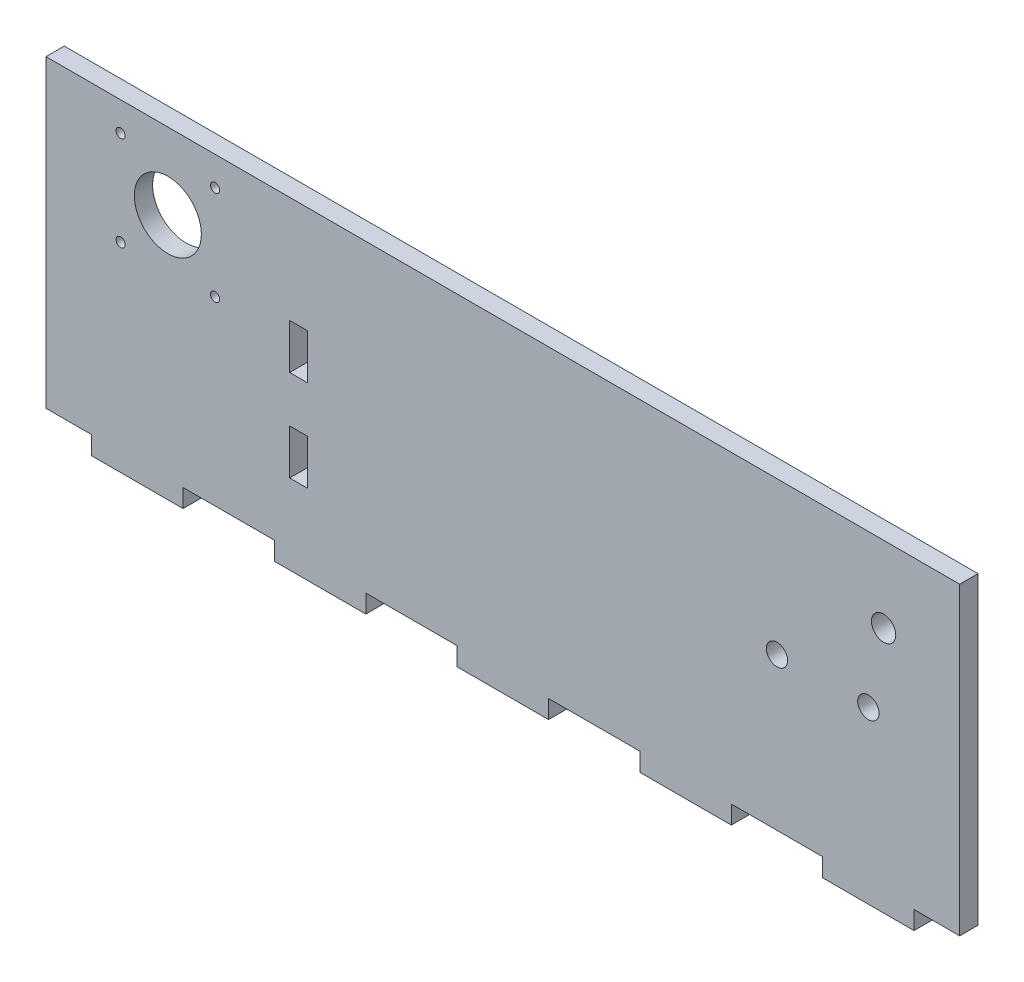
from build123d import *

# Parameters (mm, degrees)
BOSS_EXTRUDE1_DEPTH = 6
CUT_EXTRUDE1_REACH  = 162.225
SKETCH2_R           = 11
SKETCH2_R_2         = 1.5
SKETCH2_R_3         = 3.5
SKETCH2_R_4         = 4
SKETCH2_W           = 5.8
SKETCH2_H           = 14.8


with BuildPart() as part:
    # Sketch1 → Boss-Extrude1 (new body)
    with BuildSketch(Plane.XY):
        Polygon((-75, -56), (-45, -56), (-45, -50), (-15, -50), (-15, -56), (15, -56), (15, -50), (45, -50), (45, -56), (75, -56), (75, -50), (105, -50), (105, -56), (135, -56), (135, -50), (150, -50), (150, 50), (-150, 50), (-150, -50), (-135, -50), (-135, -56), (-105, -56), (-105, -50), (-75, -50), align=None)
    extrude(amount=BOSS_EXTRUDE1_DEPTH)

    # Sketch2 → Cut-Extrude1 (cut, up to next)
    with BuildSketch(Plane.XY.offset(6), mode=Mode.PRIVATE) as cut_extrude1_sk1:
        with Locations((-110, 25)):
            Circle(SKETCH2_R)
    cut_extrude1_tool1 = extrude(cut_extrude1_sk1.sketch, amount=-CUT_EXTRUDE1_REACH, mode=Mode.PRIVATE) & part.part
    # Sketch2 → Cut-Extrude1 (cut, up to next)
    with BuildSketch(Plane.XY.offset(6), mode=Mode.PRIVATE) as cut_extrude1_sk2:
        with Locations((-125.5, 40.5)):
            Circle(SKETCH2_R_2)
    cut_extrude1_tool2 = extrude(cut_extrude1_sk2.sketch, amount=-CUT_EXTRUDE1_REACH, mode=Mode.PRIVATE) & part.part
    # Sketch2 → Cut-Extrude1 (cut, up to next)
    with BuildSketch(Plane.XY.offset(6), mode=Mode.PRIVATE) as cut_extrude1_sk3:
        with Locations((-94.5, 40.5)):
            Circle(SKETCH2_R_2)
    cut_extrude1_tool3 = extrude(cut_extrude1_sk3.sketch, amount=-CUT_EXTRUDE1_REACH, mode=Mode.PRIVATE) & part.part
    # Sketch2 → Cut-Extrude1 (cut, up to next)
    with BuildSketch(Plane.XY.offset(6), mode=Mode.PRIVATE) as cut_extrude1_sk4:
        with Locations((-94.5, 9.5)):
            Circle(SKETCH2_R_2)
    cut_extrude1_tool4 = extrude(cut_extrude1_sk4.sketch, amount=-CUT_EXTRUDE1_REACH, mode=Mode.PRIVATE) & part.part
    # Sketch2 → Cut-Extrude1 (cut, up to next)
    with BuildSketch(Plane.XY.offset(6), mode=Mode.PRIVATE) as cut_extrude1_sk5:
        with Locations((-125.5, 9.5)):
            Circle(SKETCH2_R_2)
    cut_extrude1_tool5 = extrude(cut_extrude1_sk5.sketch, amount=-CUT_EXTRUDE1_REACH, mode=Mode.PRIVATE) & part.part
    # Sketch2 → Cut-Extrude1 (cut, up to next)
    with BuildSketch(Plane.XY.offset(6), mode=Mode.PRIVATE) as cut_extrude1_sk6:
        with Locations((120, 0)):
            Circle(SKETCH2_R_3)
    cut_extrude1_tool6 = extrude(cut_extrude1_sk6.sketch, amount=-CUT_EXTRUDE1_REACH, mode=Mode.PRIVATE) & part.part
    # Sketch2 → Cut-Extrude1 (cut, up to next)
    with BuildSketch(Plane.XY.offset(6), mode=Mode.PRIVATE) as cut_extrude1_sk7:
        with Locations((90, 0)):
            Circle(SKETCH2_R_3)
    cut_extrude1_tool7 = extrude(cut_extrude1_sk7.sketch, amount=-CUT_EXTRUDE1_REACH, mode=Mode.PRIVATE) & part.part
    # Sketch2 → Cut-Extrude1 (cut, up to next)
    with BuildSketch(Plane.XY.offset(6), mode=Mode.PRIVATE) as cut_extrude1_sk8:
        with Locations((125, 25)):
            Circle(SKETCH2_R_4)
    cut_extrude1_tool8 = extrude(cut_extrude1_sk8.sketch, amount=-CUT_EXTRUDE1_REACH, mode=Mode.PRIVATE) & part.part
    # Sketch2 → Cut-Extrude1 (cut, up to next)
    with BuildSketch(Plane.XY.offset(6), mode=Mode.PRIVATE) as cut_extrude1_sk9:
        with Locations((-67.1, 7.6)):
            Rectangle(SKETCH2_W, SKETCH2_H)
    cut_extrude1_tool9 = extrude(cut_extrude1_sk9.sketch, amount=-CUT_EXTRUDE1_REACH, mode=Mode.PRIVATE) & part.part
    # Sketch2 → Cut-Extrude1 (cut, up to next)
    with BuildSketch(Plane.XY.offset(6), mode=Mode.PRIVATE) as cut_extrude1_sk10:
        with Locations((-67.1, -22.4)):
            Rectangle(SKETCH2_W, SKETCH2_H)
    cut_extrude1_tool10 = extrude(cut_extrude1_sk10.sketch, amount=-CUT_EXTRUDE1_REACH, mode=Mode.PRIVATE) & part.part
    add(cut_extrude1_tool1.solids().sort_by_distance((-110, 25, 6))[0], mode=Mode.SUBTRACT)
    add(cut_extrude1_tool2.solids().sort_by_distance((-125.5, 40.5, 6))[0], mode=Mode.SUBTRACT)
    add(cut_extrude1_tool3.solids().sort_by_distance((-94.5, 40.5, 6))[0], mode=Mode.SUBTRACT)
    add(cut_extrude1_tool4.solids().sort_by_distance((-94.5, 9.5, 6))[0], mode=Mode.SUBTRACT)
    add(cut_extrude1_tool5.solids().sort_by_distance((-125.5, 9.5, 6))[0], mode=Mode.SUBTRACT)
    add(cut_extrude1_tool6.solids().sort_by_distance((120, 0, 6))[0], mode=Mode.SUBTRACT)
    add(cut_extrude1_tool7.solids().sort_by_distance((90, 0, 6))[0], mode=Mode.SUBTRACT)
    add(cut_extrude1_tool8.solids().sort_by_distance((125, 25, 6))[0], mode=Mode.SUBTRACT)
    add(cut_extrude1_tool9.solids().sort_by_distance((-67.1, 7.6, 6))[0], mode=Mode.SUBTRACT)
    add(cut_extrude1_tool10.solids().sort_by_distance((-67.1, -22.4, 6))[0], mode=Mode.SUBTRACT)


solid = part.part
